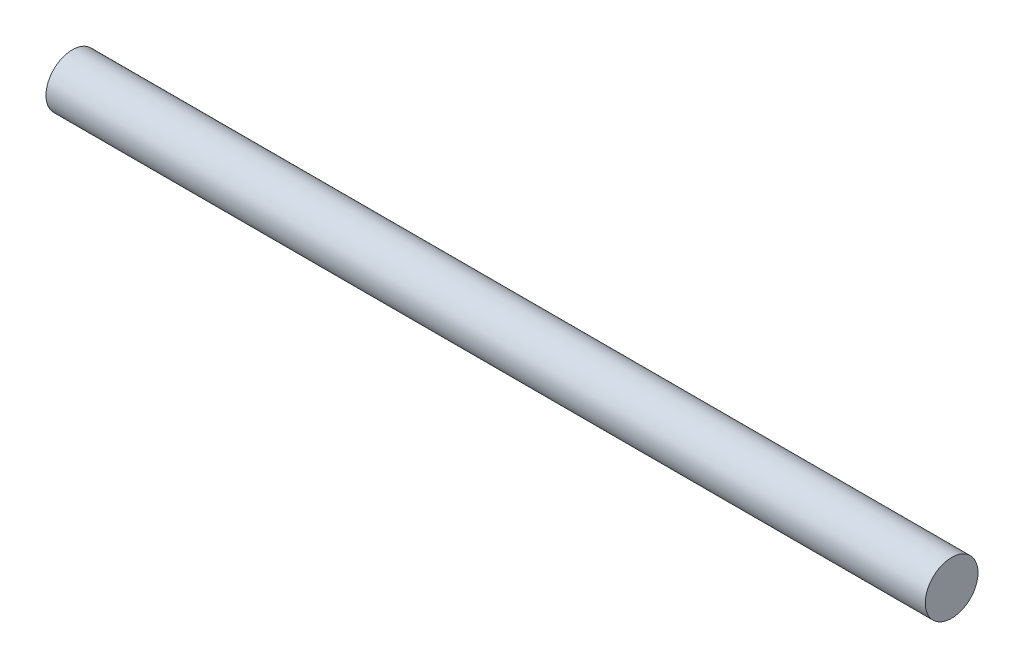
ISO-10303-21;
HEADER;
FILE_DESCRIPTION(('STEP AP214'),'2;1');
FILE_NAME('part.step','',(''),(''),'','','');
FILE_SCHEMA(('AUTOMOTIVE_DESIGN { 1 0 10303 214 1 1 1 1 }'));
ENDSEC;
DATA;
#1=APPLICATION_CONTEXT('core data for automotive mechanical design processes');
#2=APPLICATION_PROTOCOL_DEFINITION('international standard','automotive_design',2000,#1);
#3=PRODUCT_CONTEXT('',#1,'mechanical');
#4=PRODUCT('Part','Part','',(#3));
#5=PRODUCT_RELATED_PRODUCT_CATEGORY('part','',(#4));
#6=PRODUCT_DEFINITION_FORMATION('','',#4);
#7=PRODUCT_DEFINITION_CONTEXT('part definition',#1,'design');
#8=PRODUCT_DEFINITION('design','',#6,#7);
#9=PRODUCT_DEFINITION_SHAPE('','',#8);
#10=(LENGTH_UNIT() NAMED_UNIT(*) SI_UNIT(.MILLI.,.METRE.));
#11=(NAMED_UNIT(*) PLANE_ANGLE_UNIT() SI_UNIT($,.RADIAN.));
#12=(NAMED_UNIT(*) SI_UNIT($,.STERADIAN.) SOLID_ANGLE_UNIT());
#13=UNCERTAINTY_MEASURE_WITH_UNIT(LENGTH_MEASURE(1.E-05),#10,'distance_accuracy_value','');
#14=(GEOMETRIC_REPRESENTATION_CONTEXT(3) GLOBAL_UNCERTAINTY_ASSIGNED_CONTEXT((#13)) GLOBAL_UNIT_ASSIGNED_CONTEXT((#10,
#11,#12)) REPRESENTATION_CONTEXT('',''));
#15=CARTESIAN_POINT('',(0.,0.,0.));
#16=DIRECTION('',(0.,0.,1.));
#17=DIRECTION('',(1.,0.,0.));
#18=AXIS2_PLACEMENT_3D('',#15,#16,#17);
#19=CARTESIAN_POINT('',(30.,-21.8765178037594,-10.8703194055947));
#20=DIRECTION('',(-1.,0.,0.));
#21=DIRECTION('',(0.,0.,1.));
#22=AXIS2_PLACEMENT_3D('',#19,#20,#21);
#23=CYLINDRICAL_SURFACE('',#22,0.900000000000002);
#24=CARTESIAN_POINT('',(30.,-21.8765178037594,-10.8703194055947));
#25=DIRECTION('',(1.,0.,0.));
#26=DIRECTION('',(0.,0.,-1.));
#27=AXIS2_PLACEMENT_3D('',#24,#25,#26);
#28=CIRCLE('',#27,0.900000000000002);
#29=CARTESIAN_POINT('',(30.,-21.8765178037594,-11.7703194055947));
#30=VERTEX_POINT('',#29);
#31=EDGE_CURVE('E10',#30,#30,#28,.T.);
#32=ORIENTED_EDGE('',*,*,#31,.F.);
#33=EDGE_LOOP('',(#32));
#34=FACE_BOUND('',#33,.T.);
#35=CARTESIAN_POINT('',(0.,-21.8765178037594,-10.8703194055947));
#36=DIRECTION('',(1.,0.,0.));
#37=DIRECTION('',(0.,0.,-1.));
#38=AXIS2_PLACEMENT_3D('',#35,#36,#37);
#39=CIRCLE('',#38,0.900000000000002);
#40=CARTESIAN_POINT('',(0.,-21.8765178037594,-11.7703194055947));
#41=VERTEX_POINT('',#40);
#42=EDGE_CURVE('E43',#41,#41,#39,.T.);
#43=ORIENTED_EDGE('',*,*,#42,.T.);
#44=EDGE_LOOP('',(#43));
#45=FACE_BOUND('',#44,.T.);
#46=ADVANCED_FACE('F40',(#34,#45),#23,.T.);
#47=CARTESIAN_POINT('',(30.,-21.8765178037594,-10.8703194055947));
#48=DIRECTION('',(1.,0.,0.));
#49=DIRECTION('',(0.,0.,-1.));
#50=AXIS2_PLACEMENT_3D('',#47,#48,#49);
#51=PLANE('',#50);
#52=ORIENTED_EDGE('',*,*,#31,.T.);
#53=EDGE_LOOP('',(#52));
#54=FACE_BOUND('',#53,.T.);
#55=ADVANCED_FACE('F55',(#54),#51,.T.);
#56=CARTESIAN_POINT('',(0.,-21.8765178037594,-10.8703194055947));
#57=DIRECTION('',(1.,0.,0.));
#58=DIRECTION('',(0.,0.,-1.));
#59=AXIS2_PLACEMENT_3D('',#56,#57,#58);
#60=PLANE('',#59);
#61=ORIENTED_EDGE('',*,*,#42,.F.);
#62=EDGE_LOOP('',(#61));
#63=FACE_BOUND('',#62,.T.);
#64=ADVANCED_FACE('F53',(#63),#60,.F.);
#65=CLOSED_SHELL('',(#46,#55,#64));
#66=MANIFOLD_SOLID_BREP('B2',#65);
#67=ADVANCED_BREP_SHAPE_REPRESENTATION('',(#18,#66),#14);
#68=SHAPE_DEFINITION_REPRESENTATION(#9,#67);
ENDSEC;
END-ISO-10303-21;
